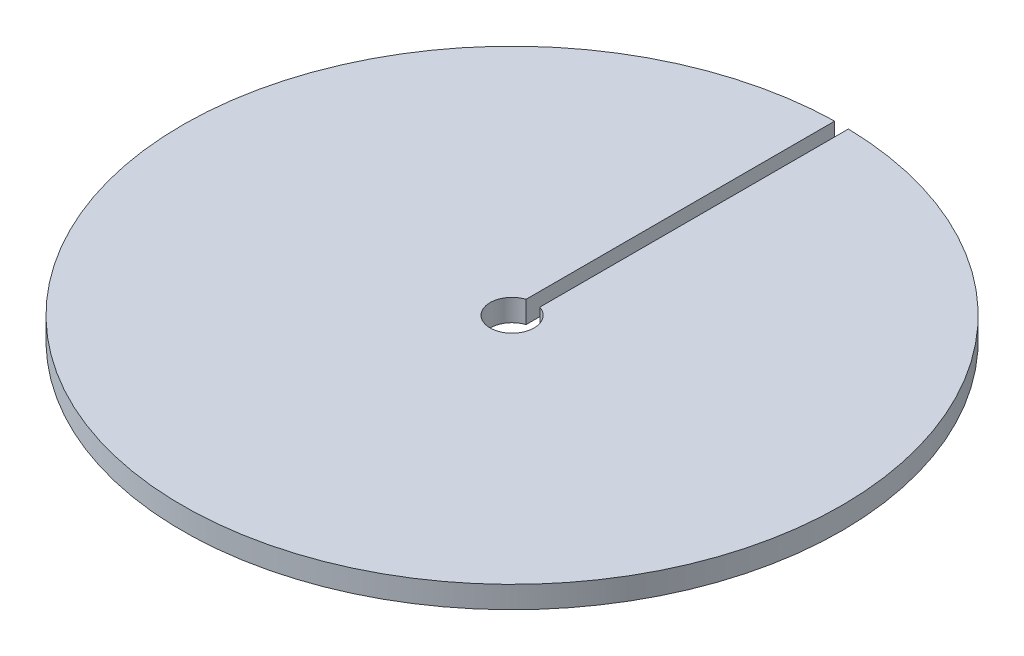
from build123d import *

# Parameters (mm, degrees)
BOSS_EXTRUDE1_DEPTH = 6.35


with BuildPart() as part:
    # Sketch1 → Boss-Extrude1 (new body)
    with BuildSketch(Plane(origin=(0, 0, 0), x_dir=(1, 0, 0), z_dir=(0, 1, 0))):
        with BuildLine():
            Line((1.977155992, 95.229477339), (1.977155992, 6.034347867))
            ThreePointArc((1.977155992, 6.034347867), (5.141859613, 3.726094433), (6.35, 0))
            ThreePointArc((6.35, 0), (-3.726094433, -5.141859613), (-1.977155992, 6.034347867))
            Line((-1.977155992, 6.034347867), (-1.977155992, 95.229477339))
            ThreePointArc((-1.977155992, 95.229477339), (-66.649225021, -68.047360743), (95.25, 0))
            ThreePointArc((95.25, 0), (68.047360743, 66.649225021), (1.977155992, 95.229477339))
        make_face()
    extrude(amount=BOSS_EXTRUDE1_DEPTH)


solid = part.part
